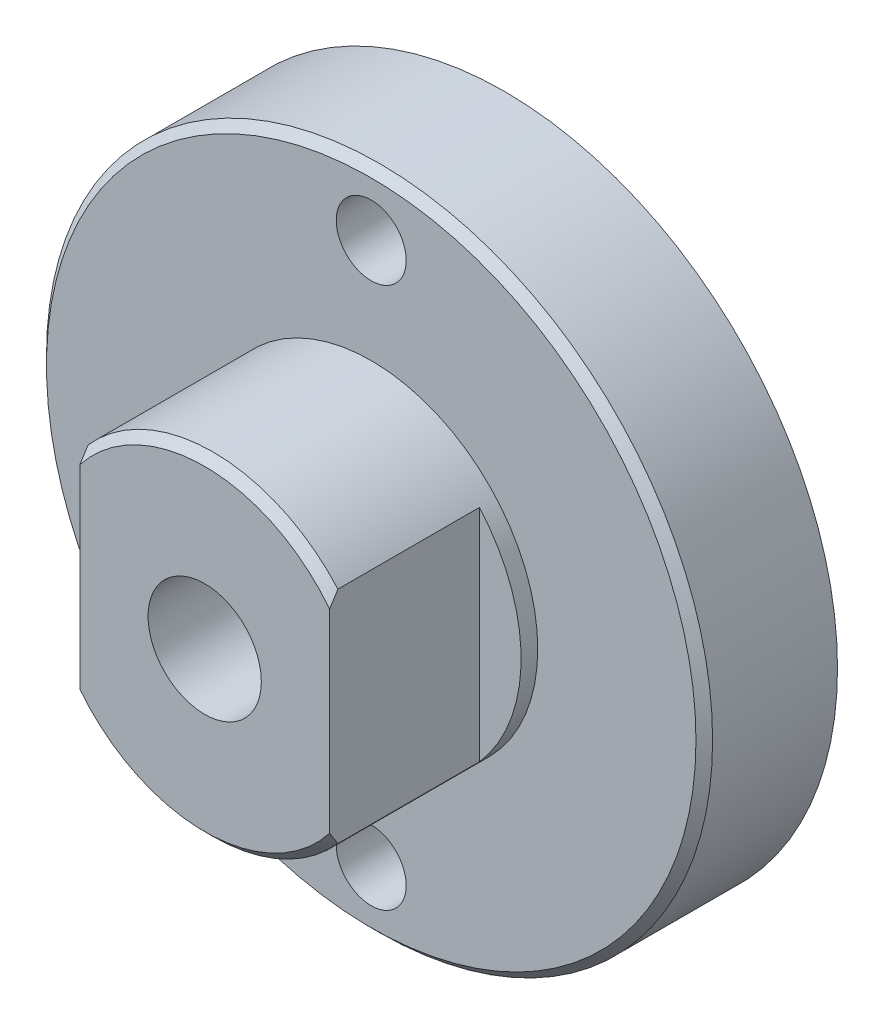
ISO-10303-21;
HEADER;
FILE_DESCRIPTION(('STEP AP214'),'2;1');
FILE_NAME('part.step','',(''),(''),'','','');
FILE_SCHEMA(('AUTOMOTIVE_DESIGN { 1 0 10303 214 1 1 1 1 }'));
ENDSEC;
DATA;
#1=APPLICATION_CONTEXT('core data for automotive mechanical design processes');
#2=APPLICATION_PROTOCOL_DEFINITION('international standard','automotive_design',2000,#1);
#3=PRODUCT_CONTEXT('',#1,'mechanical');
#4=PRODUCT('Part','Part','',(#3));
#5=PRODUCT_RELATED_PRODUCT_CATEGORY('part','',(#4));
#6=PRODUCT_DEFINITION_FORMATION('','',#4);
#7=PRODUCT_DEFINITION_CONTEXT('part definition',#1,'design');
#8=PRODUCT_DEFINITION('design','',#6,#7);
#9=PRODUCT_DEFINITION_SHAPE('','',#8);
#10=(LENGTH_UNIT() NAMED_UNIT(*) SI_UNIT(.MILLI.,.METRE.));
#11=(NAMED_UNIT(*) PLANE_ANGLE_UNIT() SI_UNIT($,.RADIAN.));
#12=(NAMED_UNIT(*) SI_UNIT($,.STERADIAN.) SOLID_ANGLE_UNIT());
#13=UNCERTAINTY_MEASURE_WITH_UNIT(LENGTH_MEASURE(1.E-05),#10,'distance_accuracy_value','');
#14=(GEOMETRIC_REPRESENTATION_CONTEXT(3) GLOBAL_UNCERTAINTY_ASSIGNED_CONTEXT((#13)) GLOBAL_UNIT_ASSIGNED_CONTEXT((#10,
#11,#12)) REPRESENTATION_CONTEXT('',''));
#15=CARTESIAN_POINT('',(0.,0.,0.));
#16=DIRECTION('',(0.,0.,1.));
#17=DIRECTION('',(1.,0.,0.));
#18=AXIS2_PLACEMENT_3D('',#15,#16,#17);
#19=CARTESIAN_POINT('',(0.,0.,18.));
#20=DIRECTION('',(0.,0.,-1.));
#21=DIRECTION('',(-1.,0.,0.));
#22=AXIS2_PLACEMENT_3D('',#19,#20,#21);
#23=CONICAL_SURFACE('',#22,9.5,0.785398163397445);
#24=CARTESIAN_POINT('',(-7.49999999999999,-13.8777569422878,11.7252690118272));
#25=CARTESIAN_POINT('',(-7.49999999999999,-13.5346780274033,12.0270292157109));
#26=CARTESIAN_POINT('',(-7.49999999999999,-13.1903954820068,12.3274375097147));
#27=CARTESIAN_POINT('',(-7.49999999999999,-12.4987296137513,12.9247701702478));
#28=CARTESIAN_POINT('',(-7.49999999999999,-12.1513458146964,13.2216939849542));
#29=CARTESIAN_POINT('',(-7.49999999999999,-11.4510953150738,13.812698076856));
#30=CARTESIAN_POINT('',(-7.49999999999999,-11.0982096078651,14.1067558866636));
#31=CARTESIAN_POINT('',(-7.49999999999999,-10.3878414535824,14.6892293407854));
#32=CARTESIAN_POINT('',(-7.49999999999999,-10.0303593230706,14.9776453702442));
#33=CARTESIAN_POINT('',(-7.49999999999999,-9.31928694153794,15.5395284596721));
#34=CARTESIAN_POINT('',(-7.49999999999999,-8.96585012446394,15.8131889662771));
#35=CARTESIAN_POINT('',(-7.49999999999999,-8.25201152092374,16.3514270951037));
#36=CARTESIAN_POINT('',(-7.49999999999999,-7.89160858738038,16.6160032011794));
#37=CARTESIAN_POINT('',(-7.49999999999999,-7.16263287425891,17.1324042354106));
#38=CARTESIAN_POINT('',(-7.49999999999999,-6.79407546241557,17.3842506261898));
#39=CARTESIAN_POINT('',(-7.49999999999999,-6.23293615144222,17.7491307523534));
#40=CARTESIAN_POINT('',(-7.49999999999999,-6.04453255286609,17.8685935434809));
#41=CARTESIAN_POINT('',(-7.49999999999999,-5.66457927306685,18.1023944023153));
#42=CARTESIAN_POINT('',(-7.49999999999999,-5.47302986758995,18.2167329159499));
#43=CARTESIAN_POINT('',(-7.49999999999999,-5.14326355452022,18.4065559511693));
#44=CARTESIAN_POINT('',(-7.49999999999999,-5.00593155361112,18.4835768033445));
#45=CARTESIAN_POINT('',(-7.49999999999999,-4.72937552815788,18.6341357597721));
#46=CARTESIAN_POINT('',(-7.49999999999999,-4.59015153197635,18.707673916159));
#47=CARTESIAN_POINT('',(-7.49999999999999,-4.1696833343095,18.922233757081));
#48=CARTESIAN_POINT('',(-7.49999999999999,-3.88538190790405,19.0573531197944));
#49=CARTESIAN_POINT('',(-7.49999999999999,-3.30522487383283,19.3082000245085));
#50=CARTESIAN_POINT('',(-7.49999999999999,-3.00929048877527,19.4237493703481));
#51=CARTESIAN_POINT('',(-7.49999999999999,-2.40734358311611,19.6282123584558));
#52=CARTESIAN_POINT('',(-7.49999999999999,-2.10130063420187,19.7170355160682));
#53=CARTESIAN_POINT('',(-7.49999999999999,-1.79076031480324,19.7891749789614));
#54=B_SPLINE_CURVE_WITH_KNOTS('',3,(#24,#25,#26,#27,#28,#29,#30,#31,#32,#33,#34,#35,#36,#37,#38,
#39,#40,#41,#42,#43,#44,#45,#46,#47,#48,#49,#50,#51,#52,#53),.UNSPECIFIED.,.F.,.F.,(4,2,2,2,2,2,
2,2,2,2,2,2,2,2,4),(0.,1.37072833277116,2.74167088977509,4.11966171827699,5.49755814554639,
6.8384387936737,8.17954215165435,9.51830330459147,10.1874982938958,10.8566349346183,
11.3289563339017,11.801270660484,12.7449939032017,13.6968954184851,14.6519843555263),.UNSPECIFIED.);
#55=CARTESIAN_POINT('',(-7.49999999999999,-6.61437827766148,17.5000000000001));
#56=VERTEX_POINT('',#55);
#57=CARTESIAN_POINT('',(-7.49999999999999,-5.83095189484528,18.));
#58=VERTEX_POINT('',#57);
#59=EDGE_CURVE('E11',#56,#58,#54,.T.);
#60=ORIENTED_EDGE('',*,*,#59,.F.);
#61=CARTESIAN_POINT('',(0.,0.,17.5000000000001));
#62=DIRECTION('',(0.,0.,1.));
#63=DIRECTION('',(1.,0.,0.));
#64=AXIS2_PLACEMENT_3D('',#61,#62,#63);
#65=CIRCLE('',#64,10.);
#66=CARTESIAN_POINT('',(7.50000000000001,-6.61437827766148,17.5000000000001));
#67=VERTEX_POINT('',#66);
#68=EDGE_CURVE('E420',#67,#56,#65,.F.);
#69=ORIENTED_EDGE('',*,*,#68,.F.);
#70=CARTESIAN_POINT('',(7.49999999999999,-1.79076031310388,19.7891749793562));
#71=CARTESIAN_POINT('',(7.49999999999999,-2.10130063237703,19.7170355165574));
#72=CARTESIAN_POINT('',(7.49999999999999,-2.40734358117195,19.6282123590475));
#73=CARTESIAN_POINT('',(7.49999999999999,-3.0092904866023,19.4237493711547));
#74=CARTESIAN_POINT('',(7.49999999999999,-3.30522487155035,19.3082000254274));
#75=CARTESIAN_POINT('',(7.5,-3.88538190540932,19.0573531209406));
#76=CARTESIAN_POINT('',(7.5,-4.169683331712,18.9222337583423));
#77=CARTESIAN_POINT('',(7.49999999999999,-4.59015152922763,18.7076739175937));
#78=CARTESIAN_POINT('',(7.49999999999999,-4.72937552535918,18.6341357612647));
#79=CARTESIAN_POINT('',(7.5,-5.00593155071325,18.4835768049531));
#80=CARTESIAN_POINT('',(7.50000000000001,-5.14326355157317,18.406555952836));
#81=CARTESIAN_POINT('',(7.50000000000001,-5.47302986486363,18.2167329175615));
#82=CARTESIAN_POINT('',(7.5,-5.66457927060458,18.1023944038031));
#83=CARTESIAN_POINT('',(7.49999999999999,-6.04453255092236,17.8685935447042));
#84=CARTESIAN_POINT('',(7.49999999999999,-6.232936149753,17.7491307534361));
#85=CARTESIAN_POINT('',(7.5,-6.79407546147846,17.3842506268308));
#86=CARTESIAN_POINT('',(7.5,-7.16263287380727,17.132404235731));
#87=CARTESIAN_POINT('',(7.49999999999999,-7.89160858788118,16.6160032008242));
#88=CARTESIAN_POINT('',(7.49999999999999,-8.25201152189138,16.3514270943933));
#89=CARTESIAN_POINT('',(7.49999999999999,-8.96585012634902,15.8131889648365));
#90=CARTESIAN_POINT('',(7.49999999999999,-9.31928694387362,15.5395284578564));
#91=CARTESIAN_POINT('',(7.49999999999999,-10.0303593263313,14.9776453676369));
#92=CARTESIAN_POINT('',(7.5,-10.3878414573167,14.6892293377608));
#93=CARTESIAN_POINT('',(7.5,-11.0982096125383,14.1067558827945));
#94=CARTESIAN_POINT('',(7.5,-11.4510953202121,13.8126980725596));
#95=CARTESIAN_POINT('',(7.5,-12.1513458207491,13.2216939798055));
#96=CARTESIAN_POINT('',(7.49999999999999,-12.4987296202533,12.924770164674));
#97=CARTESIAN_POINT('',(7.5,-13.190395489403,12.3274375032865));
#98=CARTESIAN_POINT('',(7.5,-13.5346780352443,12.0270292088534));
#99=CARTESIAN_POINT('',(7.50000000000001,-13.8777569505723,11.7252690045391));
#100=B_SPLINE_CURVE_WITH_KNOTS('',3,(#70,#71,#72,#73,#74,#75,#76,#77,#78,#79,#80,#81,#82,#83,
#84,#85,#86,#87,#88,#89,#90,#91,#92,#93,#94,#95,#96,#97,#98,#99),.UNSPECIFIED.,.F.,.F.,(4,2,2,2,
2,2,2,2,2,2,2,2,2,2,4),(0.,0.955088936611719,1.90699045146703,2.85071369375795,3.32302802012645,
3.79534941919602,4.46448606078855,5.13368105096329,6.47244220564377,7.81354556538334,
9.15442621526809,10.5323226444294,11.9103134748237,13.2812560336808,14.6519843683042),.UNSPECIFIED.);
#101=CARTESIAN_POINT('',(7.50000000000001,-5.83095189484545,18.));
#102=VERTEX_POINT('',#101);
#103=EDGE_CURVE('E460',#102,#67,#100,.T.);
#104=ORIENTED_EDGE('',*,*,#103,.F.);
#105=CARTESIAN_POINT('',(0.,0.,18.));
#106=DIRECTION('',(0.,0.,1.));
#107=DIRECTION('',(1.,0.,0.));
#108=AXIS2_PLACEMENT_3D('',#105,#106,#107);
#109=CIRCLE('',#108,9.5);
#110=EDGE_CURVE('E448',#58,#102,#109,.T.);
#111=ORIENTED_EDGE('',*,*,#110,.F.);
#112=EDGE_LOOP('',(#60,#69,#104,#111));
#113=FACE_BOUND('',#112,.T.);
#114=ADVANCED_FACE('F348',(#113),#23,.T.);
#115=CARTESIAN_POINT('',(0.,0.,8.00000000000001));
#116=DIRECTION('',(0.,0.,1.));
#117=DIRECTION('',(1.,0.,0.));
#118=AXIS2_PLACEMENT_3D('',#115,#116,#117);
#119=PLANE('',#118);
#120=CARTESIAN_POINT('',(0.,16.25,8.00000000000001));
#121=DIRECTION('',(0.,0.,1.));
#122=DIRECTION('',(1.,0.,0.));
#123=AXIS2_PLACEMENT_3D('',#120,#121,#122);
#124=CIRCLE('',#123,2.09999999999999);
#125=CARTESIAN_POINT('',(2.09999999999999,16.25,8.00000000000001));
#126=VERTEX_POINT('',#125);
#127=EDGE_CURVE('E352',#126,#126,#124,.T.);
#128=ORIENTED_EDGE('',*,*,#127,.F.);
#129=EDGE_LOOP('',(#128));
#130=FACE_BOUND('',#129,.T.);
#131=CARTESIAN_POINT('',(0.,-16.25,8.00000000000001));
#132=DIRECTION('',(0.,0.,1.));
#133=DIRECTION('',(1.,0.,0.));
#134=AXIS2_PLACEMENT_3D('',#131,#132,#133);
#135=CIRCLE('',#134,2.09999999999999);
#136=CARTESIAN_POINT('',(2.09999999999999,-16.25,8.00000000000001));
#137=VERTEX_POINT('',#136);
#138=EDGE_CURVE('E493',#137,#137,#135,.T.);
#139=ORIENTED_EDGE('',*,*,#138,.F.);
#140=EDGE_LOOP('',(#139));
#141=FACE_BOUND('',#140,.T.);
#142=CARTESIAN_POINT('',(0.,0.,8.00000000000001));
#143=DIRECTION('',(0.,0.,1.));
#144=DIRECTION('',(1.,0.,0.));
#145=AXIS2_PLACEMENT_3D('',#142,#143,#144);
#146=CIRCLE('',#145,19.5);
#147=CARTESIAN_POINT('',(19.5,0.,8.00000000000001));
#148=VERTEX_POINT('',#147);
#149=EDGE_CURVE('E442',#148,#148,#146,.T.);
#150=ORIENTED_EDGE('',*,*,#149,.T.);
#151=EDGE_LOOP('',(#150));
#152=FACE_BOUND('',#151,.T.);
#153=CARTESIAN_POINT('',(0.,0.,8.00000000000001));
#154=DIRECTION('',(0.,0.,1.));
#155=DIRECTION('',(1.,0.,0.));
#156=AXIS2_PLACEMENT_3D('',#153,#154,#155);
#157=CIRCLE('',#156,10.);
#158=CARTESIAN_POINT('',(10.,0.,8.00000000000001));
#159=VERTEX_POINT('',#158);
#160=EDGE_CURVE('E435',#159,#159,#157,.T.);
#161=ORIENTED_EDGE('',*,*,#160,.F.);
#162=EDGE_LOOP('',(#161));
#163=FACE_BOUND('',#162,.T.);
#164=ADVANCED_FACE('F523',(#130,#141,#152,#163),#119,.T.);
#165=CARTESIAN_POINT('',(0.,0.,8.00000000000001));
#166=DIRECTION('',(0.,0.,-1.));
#167=DIRECTION('',(-1.,0.,0.));
#168=AXIS2_PLACEMENT_3D('',#165,#166,#167);
#169=CYLINDRICAL_SURFACE('',#168,20.);
#170=CARTESIAN_POINT('',(0.,0.,7.50000000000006));
#171=DIRECTION('',(0.,0.,1.));
#172=DIRECTION('',(1.,0.,0.));
#173=AXIS2_PLACEMENT_3D('',#170,#171,#172);
#174=CIRCLE('',#173,20.);
#175=CARTESIAN_POINT('',(20.,0.,7.50000000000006));
#176=VERTEX_POINT('',#175);
#177=EDGE_CURVE('E445',#176,#176,#174,.F.);
#178=ORIENTED_EDGE('',*,*,#177,.T.);
#179=EDGE_LOOP('',(#178));
#180=FACE_BOUND('',#179,.T.);
#181=CARTESIAN_POINT('',(0.,0.,0.));
#182=DIRECTION('',(0.,0.,1.));
#183=DIRECTION('',(1.,0.,0.));
#184=AXIS2_PLACEMENT_3D('',#181,#182,#183);
#185=CIRCLE('',#184,20.);
#186=CARTESIAN_POINT('',(20.,0.,0.));
#187=VERTEX_POINT('',#186);
#188=EDGE_CURVE('E439',#187,#187,#185,.T.);
#189=ORIENTED_EDGE('',*,*,#188,.T.);
#190=EDGE_LOOP('',(#189));
#191=FACE_BOUND('',#190,.T.);
#192=ADVANCED_FACE('F350',(#180,#191),#169,.T.);
#193=CARTESIAN_POINT('',(0.,0.,0.));
#194=DIRECTION('',(0.,0.,1.));
#195=DIRECTION('',(1.,0.,0.));
#196=AXIS2_PLACEMENT_3D('',#193,#194,#195);
#197=PLANE('',#196);
#198=CARTESIAN_POINT('',(0.,16.25,0.));
#199=DIRECTION('',(0.,0.,-1.));
#200=DIRECTION('',(-1.,0.,0.));
#201=AXIS2_PLACEMENT_3D('',#198,#199,#200);
#202=CIRCLE('',#201,2.09999999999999);
#203=CARTESIAN_POINT('',(-2.09999999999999,16.25,0.));
#204=VERTEX_POINT('',#203);
#205=EDGE_CURVE('E505',#204,#204,#202,.T.);
#206=ORIENTED_EDGE('',*,*,#205,.F.);
#207=EDGE_LOOP('',(#206));
#208=FACE_BOUND('',#207,.T.);
#209=CARTESIAN_POINT('',(0.,-16.25,0.));
#210=DIRECTION('',(0.,0.,-1.));
#211=DIRECTION('',(-1.,0.,0.));
#212=AXIS2_PLACEMENT_3D('',#209,#210,#211);
#213=CIRCLE('',#212,2.09999999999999);
#214=CARTESIAN_POINT('',(-2.09999999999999,-16.25,0.));
#215=VERTEX_POINT('',#214);
#216=EDGE_CURVE('E495',#215,#215,#213,.T.);
#217=ORIENTED_EDGE('',*,*,#216,.F.);
#218=EDGE_LOOP('',(#217));
#219=FACE_BOUND('',#218,.T.);
#220=CARTESIAN_POINT('',(0.,0.,0.));
#221=DIRECTION('',(0.,0.,1.));
#222=DIRECTION('',(1.,0.,0.));
#223=AXIS2_PLACEMENT_3D('',#220,#221,#222);
#224=CIRCLE('',#223,3.4);
#225=CARTESIAN_POINT('',(3.4,0.,0.));
#226=VERTEX_POINT('',#225);
#227=EDGE_CURVE('E490',#226,#226,#224,.T.);
#228=ORIENTED_EDGE('',*,*,#227,.T.);
#229=EDGE_LOOP('',(#228));
#230=FACE_BOUND('',#229,.T.);
#231=ORIENTED_EDGE('',*,*,#188,.F.);
#232=EDGE_LOOP('',(#231));
#233=FACE_BOUND('',#232,.T.);
#234=ADVANCED_FACE('F513',(#208,#219,#230,#233),#197,.F.);
#235=CARTESIAN_POINT('',(0.,0.,18.));
#236=DIRECTION('',(0.,0.,-1.));
#237=DIRECTION('',(-1.,0.,0.));
#238=AXIS2_PLACEMENT_3D('',#235,#236,#237);
#239=CYLINDRICAL_SURFACE('',#238,10.);
#240=ORIENTED_EDGE('',*,*,#68,.T.);
#241=DIRECTION('',(0.,0.,1.));
#242=VECTOR('',#241,1.);
#243=CARTESIAN_POINT('',(-7.49999999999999,-6.61437827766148,8.9999999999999));
#244=LINE('',#243,#242);
#245=CARTESIAN_POINT('',(-7.49999999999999,-6.61437827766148,8.9999999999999));
#246=VERTEX_POINT('',#245);
#247=EDGE_CURVE('E411',#246,#56,#244,.T.);
#248=ORIENTED_EDGE('',*,*,#247,.F.);
#249=CARTESIAN_POINT('',(0.,0.,8.9999999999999));
#250=DIRECTION('',(0.,0.,1.));
#251=DIRECTION('',(1.,0.,0.));
#252=AXIS2_PLACEMENT_3D('',#249,#250,#251);
#253=CIRCLE('',#252,10.);
#254=CARTESIAN_POINT('',(-7.49999999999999,6.61437827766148,8.9999999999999));
#255=VERTEX_POINT('',#254);
#256=EDGE_CURVE('E404',#255,#246,#253,.T.);
#257=ORIENTED_EDGE('',*,*,#256,.F.);
#258=DIRECTION('',(0.,0.,1.));
#259=VECTOR('',#258,1.);
#260=CARTESIAN_POINT('',(-7.49999999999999,6.61437827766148,8.9999999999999));
#261=LINE('',#260,#259);
#262=CARTESIAN_POINT('',(-7.49999999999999,6.61437827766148,17.5000000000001));
#263=VERTEX_POINT('',#262);
#264=EDGE_CURVE('E413',#255,#263,#261,.T.);
#265=ORIENTED_EDGE('',*,*,#264,.T.);
#266=CARTESIAN_POINT('',(7.49999999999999,6.61437827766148,17.5000000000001));
#267=VERTEX_POINT('',#266);
#268=EDGE_CURVE('E372',#263,#267,#65,.F.);
#269=ORIENTED_EDGE('',*,*,#268,.T.);
#270=DIRECTION('',(0.,0.,1.));
#271=VECTOR('',#270,1.);
#272=CARTESIAN_POINT('',(7.49999999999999,6.61437827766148,8.9999999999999));
#273=LINE('',#272,#271);
#274=CARTESIAN_POINT('',(7.49999999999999,6.61437827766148,8.9999999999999));
#275=VERTEX_POINT('',#274);
#276=EDGE_CURVE('E432',#275,#267,#273,.T.);
#277=ORIENTED_EDGE('',*,*,#276,.F.);
#278=CARTESIAN_POINT('',(0.,0.,8.9999999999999));
#279=DIRECTION('',(0.,0.,1.));
#280=DIRECTION('',(1.,0.,0.));
#281=AXIS2_PLACEMENT_3D('',#278,#279,#280);
#282=CIRCLE('',#281,10.);
#283=CARTESIAN_POINT('',(7.50000000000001,-6.61437827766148,8.9999999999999));
#284=VERTEX_POINT('',#283);
#285=EDGE_CURVE('E427',#284,#275,#282,.T.);
#286=ORIENTED_EDGE('',*,*,#285,.F.);
#287=DIRECTION('',(0.,0.,1.));
#288=VECTOR('',#287,1.);
#289=CARTESIAN_POINT('',(7.50000000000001,-6.61437827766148,8.9999999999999));
#290=LINE('',#289,#288);
#291=EDGE_CURVE('E433',#284,#67,#290,.T.);
#292=ORIENTED_EDGE('',*,*,#291,.T.);
#293=EDGE_LOOP('',(#240,#248,#257,#265,#269,#277,#286,#292));
#294=FACE_BOUND('',#293,.T.);
#295=ORIENTED_EDGE('',*,*,#160,.T.);
#296=EDGE_LOOP('',(#295));
#297=FACE_BOUND('',#296,.T.);
#298=ADVANCED_FACE('F416',(#294,#297),#239,.T.);
#299=CARTESIAN_POINT('',(0.,0.,18.));
#300=DIRECTION('',(0.,0.,1.));
#301=DIRECTION('',(1.,0.,0.));
#302=AXIS2_PLACEMENT_3D('',#299,#300,#301);
#303=PLANE('',#302);
#304=CARTESIAN_POINT('',(0.,0.,18.));
#305=DIRECTION('',(0.,0.,1.));
#306=DIRECTION('',(1.,0.,0.));
#307=AXIS2_PLACEMENT_3D('',#304,#305,#306);
#308=CIRCLE('',#307,3.4);
#309=CARTESIAN_POINT('',(3.4,0.,18.));
#310=VERTEX_POINT('',#309);
#311=EDGE_CURVE('E492',#310,#310,#308,.T.);
#312=ORIENTED_EDGE('',*,*,#311,.F.);
#313=EDGE_LOOP('',(#312));
#314=FACE_BOUND('',#313,.T.);
#315=DIRECTION('',(0.,1.,0.));
#316=VECTOR('',#315,1.);
#317=CARTESIAN_POINT('',(-7.49999999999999,6.61437827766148,18.));
#318=LINE('',#317,#316);
#319=CARTESIAN_POINT('',(-7.49999999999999,5.83095189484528,18.));
#320=VERTEX_POINT('',#319);
#321=EDGE_CURVE('E364',#58,#320,#318,.T.);
#322=ORIENTED_EDGE('',*,*,#321,.F.);
#323=ORIENTED_EDGE('',*,*,#110,.T.);
#324=DIRECTION('',(0.,-1.,0.));
#325=VECTOR('',#324,1.);
#326=CARTESIAN_POINT('',(7.49999999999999,6.61437827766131,18.));
#327=LINE('',#326,#325);
#328=CARTESIAN_POINT('',(7.49999999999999,5.83095189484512,18.));
#329=VERTEX_POINT('',#328);
#330=EDGE_CURVE('E422',#329,#102,#327,.T.);
#331=ORIENTED_EDGE('',*,*,#330,.F.);
#332=EDGE_CURVE('E449',#329,#320,#109,.T.);
#333=ORIENTED_EDGE('',*,*,#332,.T.);
#334=EDGE_LOOP('',(#322,#323,#331,#333));
#335=FACE_BOUND('',#334,.T.);
#336=ADVANCED_FACE('F539',(#314,#335),#303,.T.);
#337=CARTESIAN_POINT('',(0.,0.,8.00000000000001));
#338=DIRECTION('',(0.,0.,-1.));
#339=DIRECTION('',(-1.,0.,0.));
#340=AXIS2_PLACEMENT_3D('',#337,#338,#339);
#341=CONICAL_SURFACE('',#340,19.5,0.785398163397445);
#342=ORIENTED_EDGE('',*,*,#177,.F.);
#343=EDGE_LOOP('',(#342));
#344=FACE_BOUND('',#343,.T.);
#345=ORIENTED_EDGE('',*,*,#149,.F.);
#346=EDGE_LOOP('',(#345));
#347=FACE_BOUND('',#346,.T.);
#348=ADVANCED_FACE('F534',(#344,#347),#341,.T.);
#349=CARTESIAN_POINT('',(-7.49999999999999,1.79076031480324,19.7891749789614));
#350=CARTESIAN_POINT('',(-7.49999999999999,2.10130063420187,19.7170355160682));
#351=CARTESIAN_POINT('',(-7.49999999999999,2.40734358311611,19.6282123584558));
#352=CARTESIAN_POINT('',(-7.49999999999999,3.00929048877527,19.4237493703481));
#353=CARTESIAN_POINT('',(-7.49999999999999,3.30522487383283,19.3082000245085));
#354=CARTESIAN_POINT('',(-7.49999999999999,3.88538190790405,19.0573531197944));
#355=CARTESIAN_POINT('',(-7.49999999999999,4.1696833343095,18.922233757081));
#356=CARTESIAN_POINT('',(-7.49999999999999,4.59015153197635,18.707673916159));
#357=CARTESIAN_POINT('',(-7.49999999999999,4.72937552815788,18.634135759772));
#358=CARTESIAN_POINT('',(-7.49999999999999,5.00593155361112,18.4835768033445));
#359=CARTESIAN_POINT('',(-7.49999999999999,5.14326355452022,18.4065559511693));
#360=CARTESIAN_POINT('',(-7.49999999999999,5.47302986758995,18.2167329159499));
#361=CARTESIAN_POINT('',(-7.49999999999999,5.66457927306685,18.1023944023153));
#362=CARTESIAN_POINT('',(-7.49999999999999,6.04453255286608,17.8685935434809));
#363=CARTESIAN_POINT('',(-7.49999999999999,6.23293615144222,17.7491307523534));
#364=CARTESIAN_POINT('',(-7.49999999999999,6.79407546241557,17.3842506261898));
#365=CARTESIAN_POINT('',(-7.49999999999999,7.16263287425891,17.1324042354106));
#366=CARTESIAN_POINT('',(-7.49999999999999,7.89160858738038,16.6160032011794));
#367=CARTESIAN_POINT('',(-7.49999999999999,8.25201152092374,16.3514270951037));
#368=CARTESIAN_POINT('',(-7.49999999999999,8.96585012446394,15.8131889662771));
#369=CARTESIAN_POINT('',(-7.49999999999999,9.31928694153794,15.5395284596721));
#370=CARTESIAN_POINT('',(-7.49999999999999,10.0303593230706,14.9776453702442));
#371=CARTESIAN_POINT('',(-7.49999999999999,10.3878414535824,14.6892293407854));
#372=CARTESIAN_POINT('',(-7.49999999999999,11.0982096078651,14.1067558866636));
#373=CARTESIAN_POINT('',(-7.49999999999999,11.4510953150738,13.8126980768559));
#374=CARTESIAN_POINT('',(-7.49999999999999,12.1513458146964,13.2216939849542));
#375=CARTESIAN_POINT('',(-7.49999999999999,12.4987296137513,12.9247701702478));
#376=CARTESIAN_POINT('',(-7.49999999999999,13.1903954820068,12.3274375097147));
#377=CARTESIAN_POINT('',(-7.5,13.5346780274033,12.0270292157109));
#378=CARTESIAN_POINT('',(-7.50000000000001,13.8777569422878,11.7252690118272));
#379=B_SPLINE_CURVE_WITH_KNOTS('',3,(#349,#350,#351,#352,#353,#354,#355,#356,#357,#358,#359,
#360,#361,#362,#363,#364,#365,#366,#367,#368,#369,#370,#371,#372,#373,#374,#375,#376,#377,#378),
.UNSPECIFIED.,.F.,.F.,(4,2,2,2,2,2,2,2,2,2,2,2,2,2,4),(0.,0.955088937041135,1.90699045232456,
2.85071369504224,3.32302802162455,3.79534942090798,4.46448606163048,5.1336810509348,
6.47244220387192,7.81354556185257,9.15442620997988,10.5323226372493,11.9103134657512,
13.2812560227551,14.6519843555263),.UNSPECIFIED.);
#380=EDGE_CURVE('E357',#320,#263,#379,.T.);
#381=ORIENTED_EDGE('',*,*,#380,.F.);
#382=ORIENTED_EDGE('',*,*,#332,.F.);
#383=CARTESIAN_POINT('',(7.49999999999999,13.8777569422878,11.7252690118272));
#384=CARTESIAN_POINT('',(7.49999999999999,13.5346780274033,12.0270292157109));
#385=CARTESIAN_POINT('',(7.49999999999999,13.1903954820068,12.3274375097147));
#386=CARTESIAN_POINT('',(7.49999999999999,12.4987296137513,12.9247701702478));
#387=CARTESIAN_POINT('',(7.49999999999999,12.1513458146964,13.2216939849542));
#388=CARTESIAN_POINT('',(7.49999999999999,11.4510953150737,13.812698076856));
#389=CARTESIAN_POINT('',(7.49999999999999,11.0982096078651,14.1067558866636));
#390=CARTESIAN_POINT('',(7.49999999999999,10.3878414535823,14.6892293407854));
#391=CARTESIAN_POINT('',(7.49999999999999,10.0303593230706,14.9776453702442));
#392=CARTESIAN_POINT('',(7.49999999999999,9.31928694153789,15.5395284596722));
#393=CARTESIAN_POINT('',(7.49999999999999,8.96585012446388,15.8131889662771));
#394=CARTESIAN_POINT('',(7.49999999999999,8.25201152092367,16.3514270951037));
#395=CARTESIAN_POINT('',(7.49999999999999,7.89160858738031,16.6160032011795));
#396=CARTESIAN_POINT('',(7.49999999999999,7.16263287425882,17.1324042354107));
#397=CARTESIAN_POINT('',(7.49999999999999,6.79407546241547,17.3842506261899));
#398=CARTESIAN_POINT('',(7.49999999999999,6.23293615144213,17.7491307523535));
#399=CARTESIAN_POINT('',(7.49999999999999,6.044532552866,17.868593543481));
#400=CARTESIAN_POINT('',(7.49999999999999,5.66457927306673,18.1023944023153));
#401=CARTESIAN_POINT('',(7.49999999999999,5.47302986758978,18.2167329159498));
#402=CARTESIAN_POINT('',(7.49999999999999,5.14326355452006,18.4065559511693));
#403=CARTESIAN_POINT('',(7.49999999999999,5.00593155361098,18.4835768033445));
#404=CARTESIAN_POINT('',(7.49999999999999,4.72937552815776,18.6341357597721));
#405=CARTESIAN_POINT('',(7.49999999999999,4.59015153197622,18.7076739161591));
#406=CARTESIAN_POINT('',(7.49999999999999,4.16968333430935,18.9222337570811));
#407=CARTESIAN_POINT('',(7.49999999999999,3.88538190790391,19.0573531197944));
#408=CARTESIAN_POINT('',(7.49999999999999,3.30522487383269,19.3082000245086));
#409=CARTESIAN_POINT('',(7.49999999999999,3.00929048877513,19.4237493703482));
#410=CARTESIAN_POINT('',(7.49999999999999,2.40734358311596,19.6282123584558));
#411=CARTESIAN_POINT('',(7.49999999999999,2.10130063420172,19.7170355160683));
#412=CARTESIAN_POINT('',(7.49999999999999,1.79076031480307,19.7891749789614));
#413=B_SPLINE_CURVE_WITH_KNOTS('',3,(#383,#384,#385,#386,#387,#388,#389,#390,#391,#392,#393,
#394,#395,#396,#397,#398,#399,#400,#401,#402,#403,#404,#405,#406,#407,#408,#409,#410,#411,#412),
.UNSPECIFIED.,.F.,.F.,(4,2,2,2,2,2,2,2,2,2,2,2,2,2,4),(0.,1.37072833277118,2.74167088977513,
4.11966171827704,5.49755814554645,6.83843879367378,8.17954215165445,9.51830330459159,
10.1874982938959,10.8566349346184,11.3289563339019,11.8012706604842,12.7449939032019,
13.6968954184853,14.6519843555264),.UNSPECIFIED.);
#414=EDGE_CURVE('E453',#267,#329,#413,.T.);
#415=ORIENTED_EDGE('',*,*,#414,.F.);
#416=ORIENTED_EDGE('',*,*,#268,.F.);
#417=EDGE_LOOP('',(#381,#382,#415,#416));
#418=FACE_BOUND('',#417,.T.);
#419=ADVANCED_FACE('F465',(#418),#23,.T.);
#420=CARTESIAN_POINT('',(7.49999999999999,6.61437827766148,8.9999999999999));
#421=DIRECTION('',(-1.,0.,0.));
#422=DIRECTION('',(0.,-1.,0.));
#423=AXIS2_PLACEMENT_3D('',#420,#421,#422);
#424=PLANE('',#423);
#425=ORIENTED_EDGE('',*,*,#103,.T.);
#426=ORIENTED_EDGE('',*,*,#291,.F.);
#427=DIRECTION('',(0.,-1.,0.));
#428=VECTOR('',#427,1.);
#429=CARTESIAN_POINT('',(7.49999999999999,6.61437827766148,8.9999999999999));
#430=LINE('',#429,#428);
#431=EDGE_CURVE('E429',#275,#284,#430,.T.);
#432=ORIENTED_EDGE('',*,*,#431,.F.);
#433=ORIENTED_EDGE('',*,*,#276,.T.);
#434=ORIENTED_EDGE('',*,*,#414,.T.);
#435=ORIENTED_EDGE('',*,*,#330,.T.);
#436=EDGE_LOOP('',(#425,#426,#432,#433,#434,#435));
#437=FACE_BOUND('',#436,.T.);
#438=ADVANCED_FACE('F468',(#437),#424,.F.);
#439=CARTESIAN_POINT('',(0.,0.,8.9999999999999));
#440=DIRECTION('',(0.,0.,1.));
#441=DIRECTION('',(1.,0.,0.));
#442=AXIS2_PLACEMENT_3D('',#439,#440,#441);
#443=PLANE('',#442);
#444=ORIENTED_EDGE('',*,*,#285,.T.);
#445=ORIENTED_EDGE('',*,*,#431,.T.);
#446=EDGE_LOOP('',(#444,#445));
#447=FACE_BOUND('',#446,.T.);
#448=ADVANCED_FACE('F472',(#447),#443,.T.);
#449=CARTESIAN_POINT('',(-7.49999999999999,6.61437827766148,8.9999999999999));
#450=DIRECTION('',(1.,0.,0.));
#451=DIRECTION('',(0.,0.,-1.));
#452=AXIS2_PLACEMENT_3D('',#449,#450,#451);
#453=PLANE('',#452);
#454=ORIENTED_EDGE('',*,*,#59,.T.);
#455=ORIENTED_EDGE('',*,*,#321,.T.);
#456=ORIENTED_EDGE('',*,*,#380,.T.);
#457=ORIENTED_EDGE('',*,*,#264,.F.);
#458=DIRECTION('',(0.,1.,0.));
#459=VECTOR('',#458,1.);
#460=CARTESIAN_POINT('',(-7.49999999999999,6.61437827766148,8.9999999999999));
#461=LINE('',#460,#459);
#462=EDGE_CURVE('E407',#246,#255,#461,.T.);
#463=ORIENTED_EDGE('',*,*,#462,.F.);
#464=ORIENTED_EDGE('',*,*,#247,.T.);
#465=EDGE_LOOP('',(#454,#455,#456,#457,#463,#464));
#466=FACE_BOUND('',#465,.T.);
#467=ADVANCED_FACE('F410',(#466),#453,.F.);
#468=CARTESIAN_POINT('',(0.,0.,8.9999999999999));
#469=DIRECTION('',(0.,0.,1.));
#470=DIRECTION('',(1.,0.,0.));
#471=AXIS2_PLACEMENT_3D('',#468,#469,#470);
#472=PLANE('',#471);
#473=ORIENTED_EDGE('',*,*,#256,.T.);
#474=ORIENTED_EDGE('',*,*,#462,.T.);
#475=EDGE_LOOP('',(#473,#474));
#476=FACE_BOUND('',#475,.T.);
#477=ADVANCED_FACE('F406',(#476),#472,.T.);
#478=CARTESIAN_POINT('',(0.,0.,18.));
#479=DIRECTION('',(0.,0.,1.));
#480=DIRECTION('',(1.,0.,0.));
#481=AXIS2_PLACEMENT_3D('',#478,#479,#480);
#482=CYLINDRICAL_SURFACE('',#481,3.4);
#483=ORIENTED_EDGE('',*,*,#311,.T.);
#484=EDGE_LOOP('',(#483));
#485=FACE_BOUND('',#484,.T.);
#486=ORIENTED_EDGE('',*,*,#227,.F.);
#487=EDGE_LOOP('',(#486));
#488=FACE_BOUND('',#487,.T.);
#489=ADVANCED_FACE('F558',(#485,#488),#482,.F.);
#490=CARTESIAN_POINT('',(0.,-16.25,0.));
#491=DIRECTION('',(0.,0.,-1.));
#492=DIRECTION('',(-1.,0.,0.));
#493=AXIS2_PLACEMENT_3D('',#490,#491,#492);
#494=CYLINDRICAL_SURFACE('',#493,2.09999999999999);
#495=ORIENTED_EDGE('',*,*,#138,.T.);
#496=EDGE_LOOP('',(#495));
#497=FACE_BOUND('',#496,.T.);
#498=ORIENTED_EDGE('',*,*,#216,.T.);
#499=EDGE_LOOP('',(#498));
#500=FACE_BOUND('',#499,.T.);
#501=ADVANCED_FACE('F561',(#497,#500),#494,.F.);
#502=CARTESIAN_POINT('',(0.,16.25,0.));
#503=DIRECTION('',(0.,0.,-1.));
#504=DIRECTION('',(-1.,0.,0.));
#505=AXIS2_PLACEMENT_3D('',#502,#503,#504);
#506=CYLINDRICAL_SURFACE('',#505,2.09999999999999);
#507=ORIENTED_EDGE('',*,*,#127,.T.);
#508=EDGE_LOOP('',(#507));
#509=FACE_BOUND('',#508,.T.);
#510=ORIENTED_EDGE('',*,*,#205,.T.);
#511=EDGE_LOOP('',(#510));
#512=FACE_BOUND('',#511,.T.);
#513=ADVANCED_FACE('F511',(#509,#512),#506,.F.);
#514=CLOSED_SHELL('',(#114,#164,#192,#234,#298,#336,#348,#419,#438,#448,#467,#477,#489,#501,#513));
#515=MANIFOLD_SOLID_BREP('B2',#514);
#516=ADVANCED_BREP_SHAPE_REPRESENTATION('',(#18,#515),#14);
#517=SHAPE_DEFINITION_REPRESENTATION(#9,#516);
ENDSEC;
END-ISO-10303-21;
